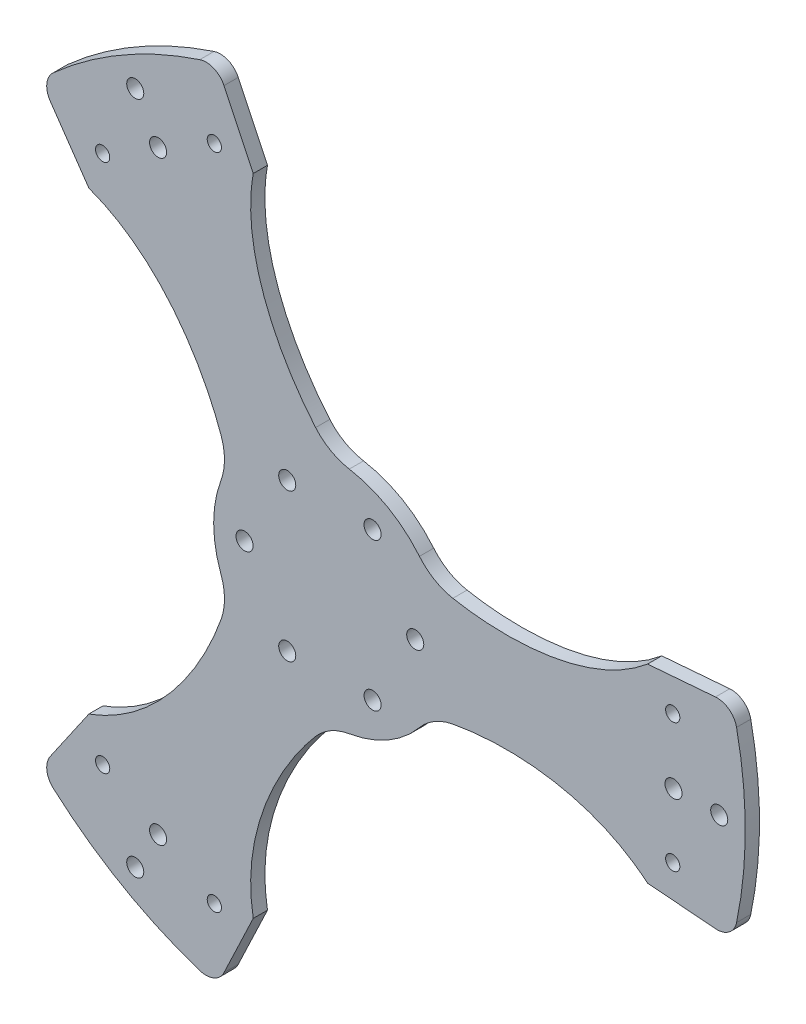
from build123d import *

# Parameters (mm, degrees)
SKETCH3_R           = 2.5
SKETCH3_R_2         = 3
BOSS_EXTRUDE2_DEPTH = 5
FILLET6_R           = 20
FILLET7_R           = 7
SKETCH4_R           = 3
CUT_EXTRUDE1_DEPTH  = 10


with BuildPart() as part:
    # Sketch3 → Boss-Extrude2 (new body)
    with BuildSketch(Plane.XY):
        with BuildLine():
            ThreePointArc((-39.817765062, 140.487423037), (-73.010565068, 126.458008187), (-101.756794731, 104.726907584))
            Line((-101.756794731, 104.726907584), (-84.725907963, 80.038619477))
            add(Edge.make_bspline(
                [(-84.725907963, 80.038619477), (-56.647047, 69.8615718), (-40.45893036, 39.152316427), (-35.778221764, 19.759213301)],
                knots=[0, 0, 0, 0, 1, 1, 1, 1], degree=3))
            ThreePointArc((-35.778221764, 19.759213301), (-40.871844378, 0), (-35.778221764, -19.759213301))
            add(Edge.make_bspline(
                [(-84.725907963, -80.038619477), (-56.647047, -69.8615718), (-40.45893036, -39.152316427), (-35.778221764, -19.759213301)],
                knots=[0, 0, 0, 0, 1, 1, 1, 1], degree=3))
            Line((-84.725907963, -80.038619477), (-101.756794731, -104.726907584))
            ThreePointArc((-101.756794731, -104.726907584), (-73.010565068, -126.458008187), (-39.817765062, -140.487423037))
            Line((-39.817765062, -140.487423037), (-26.952523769, -113.394098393))
            add(Edge.make_bspline(
                [(-26.952523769, -113.394098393), (-32.178372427, -83.988567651), (-13.677435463, -54.614619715), (0.777130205, -40.864455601)],
                knots=[0, 0, 0, 0, 1, 1, 1, 1], degree=3))
            ThreePointArc((0.777130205, -40.864455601), (20.435922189, -35.396055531), (35.00109156, -21.1052423))
            add(Edge.make_bspline(
                [(111.678431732, -33.355478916), (88.825419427, -14.126995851), (54.136365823, -15.462303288), (35.00109156, -21.1052423)],
                knots=[0, 0, 0, 0, 1, 1, 1, 1], degree=3))
            Line((111.678431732, -33.355478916), (141.574559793, -35.760515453))
            ThreePointArc((141.574559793, -35.760515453), (146.021130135, 0), (141.574559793, 35.760515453))
            Line((141.574559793, 35.760515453), (111.678431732, 33.355478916))
            add(Edge.make_bspline(
                [(111.678431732, 33.355478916), (88.825419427, 14.126995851), (54.136365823, 15.462303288), (35.00109156, 21.1052423)],
                knots=[0, 0, 0, 0, 1, 1, 1, 1], degree=3))
            ThreePointArc((35.00109156, 21.1052423), (20.435922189, 35.396055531), (0.777130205, 40.864455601))
            add(Edge.make_bspline(
                [(-26.952523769, 113.394098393), (-32.178372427, 83.988567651), (-13.677435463, 54.614619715), (0.777130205, 40.864455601)],
                knots=[0, 0, 0, 0, 1, 1, 1, 1], degree=3))
            Line((-26.952523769, 113.394098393), (-39.817765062, 140.487423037))
        make_face()
        with Locations((-79.894313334, 93.04415631)):
            Circle(SKETCH3_R, mode=Mode.SUBTRACT)
        with Locations((-68.435114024, 118.533094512)):
            Circle(SKETCH3_R_2, mode=Mode.SUBTRACT)
        with Locations((-40.631446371, 115.71258312)):
            Circle(SKETCH3_R, mode=Mode.SUBTRACT)
        with Locations((-60.398124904, 104.612621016)):
            Circle(SKETCH3_R_2, mode=Mode.SUBTRACT)
        with Locations((136.870228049, 0)):
            Circle(SKETCH3_R_2, mode=Mode.SUBTRACT)
        with Locations((120.796249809, 0)):
            Circle(SKETCH3_R_2, mode=Mode.SUBTRACT)
        with Locations((120.525759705, 22.66842681)):
            Circle(SKETCH3_R, mode=Mode.SUBTRACT)
        with Locations((120.525759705, -22.66842681)):
            Circle(SKETCH3_R, mode=Mode.SUBTRACT)
        with Locations((-68.435114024, -118.533094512)):
            Circle(SKETCH3_R_2, mode=Mode.SUBTRACT)
        with Locations((-60.398124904, -104.612621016)):
            Circle(SKETCH3_R_2, mode=Mode.SUBTRACT)
        with Locations((-40.631446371, -115.71258312)):
            Circle(SKETCH3_R, mode=Mode.SUBTRACT)
        with Locations((-79.894313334, -93.04415631)):
            Circle(SKETCH3_R, mode=Mode.SUBTRACT)
    extrude(amount=BOSS_EXTRUDE2_DEPTH)

    # Fillet6
    fillet6_edges = [part.edges().sort_by_distance(p)[0] for p in [
        (35.00109156, -21.1052423, 2.5),
        (0.777130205, -40.864455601, 2.5),
        (0.777130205, 40.864455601, 2.5),
        (35.00109156, 21.1052423, 2.5),
        (-35.778221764, -19.759213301, 2.5),
        (-35.778221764, 19.759213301, 2.5),
    ]]
    fillet(fillet6_edges, radius=FILLET6_R)

    # Fillet7
    fillet7_edges = [part.edges().sort_by_distance(p)[0] for p in [
        (-101.756794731, -104.726907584, 2.5),
        (-39.817765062, -140.487423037, 2.5),
        (141.574559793, -35.760515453, 2.5),
        (141.574559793, 35.760515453, 2.5),
        (-39.817765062, 140.487423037, 2.5),
        (-101.756794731, 104.726907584, 2.5),
    ]]
    fillet(fillet7_edges, radius=FILLET7_R)

    # Sketch4 → Cut-Extrude1 (cut)
    with BuildSketch(Plane.XY.offset(5)):
        with Locations((15, 25.980762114)):
            Circle(SKETCH4_R)
        with Locations((30, 0)):
            Circle(SKETCH4_R)
        with Locations((15, -25.980762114)):
            Circle(SKETCH4_R)
        with Locations((-15, -25.980762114)):
            Circle(SKETCH4_R)
        with Locations((-30, 0)):
            Circle(SKETCH4_R)
        with Locations((-15, 25.980762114)):
            Circle(SKETCH4_R)
    extrude(amount=-CUT_EXTRUDE1_DEPTH, mode=Mode.SUBTRACT)


solid = part.part
